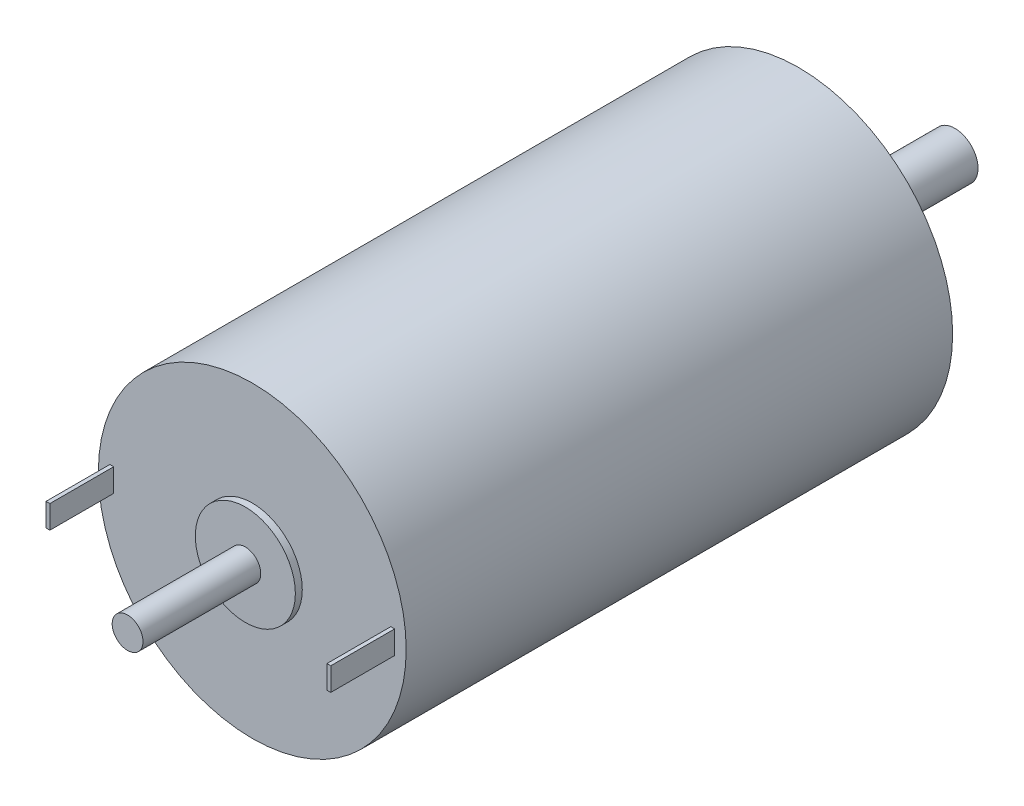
ISO-10303-21;
HEADER;
FILE_DESCRIPTION(('STEP AP214'),'2;1');
FILE_NAME('part.step','',(''),(''),'','','');
FILE_SCHEMA(('AUTOMOTIVE_DESIGN { 1 0 10303 214 1 1 1 1 }'));
ENDSEC;
DATA;
#1=APPLICATION_CONTEXT('core data for automotive mechanical design processes');
#2=APPLICATION_PROTOCOL_DEFINITION('international standard','automotive_design',2000,#1);
#3=PRODUCT_CONTEXT('',#1,'mechanical');
#4=PRODUCT('Part','Part','',(#3));
#5=PRODUCT_RELATED_PRODUCT_CATEGORY('part','',(#4));
#6=PRODUCT_DEFINITION_FORMATION('','',#4);
#7=PRODUCT_DEFINITION_CONTEXT('part definition',#1,'design');
#8=PRODUCT_DEFINITION('design','',#6,#7);
#9=PRODUCT_DEFINITION_SHAPE('','',#8);
#10=(LENGTH_UNIT() NAMED_UNIT(*) SI_UNIT(.MILLI.,.METRE.));
#11=(NAMED_UNIT(*) PLANE_ANGLE_UNIT() SI_UNIT($,.RADIAN.));
#12=(NAMED_UNIT(*) SI_UNIT($,.STERADIAN.) SOLID_ANGLE_UNIT());
#13=UNCERTAINTY_MEASURE_WITH_UNIT(LENGTH_MEASURE(1.E-05),#10,'distance_accuracy_value','');
#14=(GEOMETRIC_REPRESENTATION_CONTEXT(3) GLOBAL_UNCERTAINTY_ASSIGNED_CONTEXT((#13)) GLOBAL_UNIT_ASSIGNED_CONTEXT((#10,
#11,#12)) REPRESENTATION_CONTEXT('',''));
#15=CARTESIAN_POINT('',(0.,0.,0.));
#16=DIRECTION('',(0.,0.,1.));
#17=DIRECTION('',(1.,0.,0.));
#18=AXIS2_PLACEMENT_3D('',#15,#16,#17);
#19=CARTESIAN_POINT('',(0.,0.,-3.5));
#20=DIRECTION('',(0.,0.,-1.));
#21=DIRECTION('',(-1.,0.,0.));
#22=AXIS2_PLACEMENT_3D('',#19,#20,#21);
#23=PLANE('',#22);
#24=CARTESIAN_POINT('',(0.,0.,-3.5));
#25=DIRECTION('',(0.,0.,-1.));
#26=DIRECTION('',(-1.,0.,0.));
#27=AXIS2_PLACEMENT_3D('',#24,#25,#26);
#28=CIRCLE('',#27,4.);
#29=CARTESIAN_POINT('',(-4.,0.,-3.5));
#30=VERTEX_POINT('',#29);
#31=EDGE_CURVE('E328',#30,#30,#28,.T.);
#32=ORIENTED_EDGE('',*,*,#31,.T.);
#33=EDGE_LOOP('',(#32));
#34=FACE_BOUND('',#33,.T.);
#35=CARTESIAN_POINT('',(0.,0.,-3.5));
#36=DIRECTION('',(0.,0.,-1.));
#37=DIRECTION('',(-1.,0.,0.));
#38=AXIS2_PLACEMENT_3D('',#35,#36,#37);
#39=CIRCLE('',#38,3.);
#40=CARTESIAN_POINT('',(-3.,0.,-3.5));
#41=VERTEX_POINT('',#40);
#42=EDGE_CURVE('E34',#41,#41,#39,.F.);
#43=ORIENTED_EDGE('',*,*,#42,.T.);
#44=EDGE_LOOP('',(#43));
#45=FACE_BOUND('',#44,.T.);
#46=ADVANCED_FACE('F30',(#34,#45),#23,.T.);
#47=CARTESIAN_POINT('',(0.,0.,-1.4));
#48=DIRECTION('',(0.,0.,-1.));
#49=DIRECTION('',(-1.,0.,0.));
#50=AXIS2_PLACEMENT_3D('',#47,#48,#49);
#51=PLANE('',#50);
#52=CARTESIAN_POINT('',(0.,0.,-1.4));
#53=DIRECTION('',(0.,0.,-1.));
#54=DIRECTION('',(-1.,0.,0.));
#55=AXIS2_PLACEMENT_3D('',#52,#53,#54);
#56=CIRCLE('',#55,8.);
#57=CARTESIAN_POINT('',(-8.,0.,-1.4));
#58=VERTEX_POINT('',#57);
#59=EDGE_CURVE('E119',#58,#58,#56,.T.);
#60=ORIENTED_EDGE('',*,*,#59,.T.);
#61=EDGE_LOOP('',(#60));
#62=FACE_BOUND('',#61,.T.);
#63=CARTESIAN_POINT('',(0.,0.,-1.4));
#64=DIRECTION('',(0.,0.,-1.));
#65=DIRECTION('',(-1.,0.,0.));
#66=AXIS2_PLACEMENT_3D('',#63,#64,#65);
#67=CIRCLE('',#66,4.);
#68=CARTESIAN_POINT('',(-4.,0.,-1.4));
#69=VERTEX_POINT('',#68);
#70=EDGE_CURVE('E325',#69,#69,#67,.T.);
#71=ORIENTED_EDGE('',*,*,#70,.F.);
#72=EDGE_LOOP('',(#71));
#73=FACE_BOUND('',#72,.T.);
#74=ADVANCED_FACE('F195',(#62,#73),#51,.T.);
#75=CARTESIAN_POINT('',(0.,0.,0.));
#76=DIRECTION('',(0.,0.,1.));
#77=DIRECTION('',(1.,0.,0.));
#78=AXIS2_PLACEMENT_3D('',#75,#76,#77);
#79=PLANE('',#78);
#80=CARTESIAN_POINT('',(-5.50000000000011,9.52627944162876,0.));
#81=DIRECTION('',(0.,0.,-1.));
#82=DIRECTION('',(-1.,0.,0.));
#83=AXIS2_PLACEMENT_3D('',#80,#81,#82);
#84=CIRCLE('',#83,1.5);
#85=CARTESIAN_POINT('',(-7.00000000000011,9.52627944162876,0.));
#86=VERTEX_POINT('',#85);
#87=EDGE_CURVE('E288',#86,#86,#84,.T.);
#88=ORIENTED_EDGE('',*,*,#87,.F.);
#89=EDGE_LOOP('',(#88));
#90=FACE_BOUND('',#89,.T.);
#91=CARTESIAN_POINT('',(5.49999999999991,9.52627944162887,0.));
#92=DIRECTION('',(0.,0.,-1.));
#93=DIRECTION('',(-1.,0.,0.));
#94=AXIS2_PLACEMENT_3D('',#91,#92,#93);
#95=CIRCLE('',#94,1.5);
#96=CARTESIAN_POINT('',(3.99999999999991,9.52627944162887,0.));
#97=VERTEX_POINT('',#96);
#98=EDGE_CURVE('E287',#97,#97,#95,.T.);
#99=ORIENTED_EDGE('',*,*,#98,.F.);
#100=EDGE_LOOP('',(#99));
#101=FACE_BOUND('',#100,.T.);
#102=CARTESIAN_POINT('',(11.,0.,0.));
#103=DIRECTION('',(0.,0.,-1.));
#104=DIRECTION('',(-1.,0.,0.));
#105=AXIS2_PLACEMENT_3D('',#102,#103,#104);
#106=CIRCLE('',#105,1.5);
#107=CARTESIAN_POINT('',(9.5,0.,0.));
#108=VERTEX_POINT('',#107);
#109=EDGE_CURVE('E298',#108,#108,#106,.T.);
#110=ORIENTED_EDGE('',*,*,#109,.F.);
#111=EDGE_LOOP('',(#110));
#112=FACE_BOUND('',#111,.T.);
#113=CARTESIAN_POINT('',(5.50000000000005,-9.5262794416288,0.));
#114=DIRECTION('',(0.,0.,-1.));
#115=DIRECTION('',(-1.,0.,0.));
#116=AXIS2_PLACEMENT_3D('',#113,#114,#115);
#117=CIRCLE('',#116,1.5);
#118=CARTESIAN_POINT('',(4.00000000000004,-9.5262794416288,0.));
#119=VERTEX_POINT('',#118);
#120=EDGE_CURVE('E304',#119,#119,#117,.T.);
#121=ORIENTED_EDGE('',*,*,#120,.F.);
#122=EDGE_LOOP('',(#121));
#123=FACE_BOUND('',#122,.T.);
#124=CARTESIAN_POINT('',(-5.49999999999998,-9.52627944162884,0.));
#125=DIRECTION('',(0.,0.,-1.));
#126=DIRECTION('',(-1.,0.,0.));
#127=AXIS2_PLACEMENT_3D('',#124,#125,#126);
#128=CIRCLE('',#127,1.5);
#129=CARTESIAN_POINT('',(-6.99999999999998,-9.52627944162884,0.));
#130=VERTEX_POINT('',#129);
#131=EDGE_CURVE('E310',#130,#130,#128,.T.);
#132=ORIENTED_EDGE('',*,*,#131,.F.);
#133=EDGE_LOOP('',(#132));
#134=FACE_BOUND('',#133,.T.);
#135=CARTESIAN_POINT('',(-11.,0.,0.));
#136=DIRECTION('',(0.,0.,-1.));
#137=DIRECTION('',(-1.,0.,0.));
#138=AXIS2_PLACEMENT_3D('',#135,#136,#137);
#139=CIRCLE('',#138,1.5);
#140=CARTESIAN_POINT('',(-12.5,0.,0.));
#141=VERTEX_POINT('',#140);
#142=EDGE_CURVE('E316',#141,#141,#139,.T.);
#143=ORIENTED_EDGE('',*,*,#142,.F.);
#144=EDGE_LOOP('',(#143));
#145=FACE_BOUND('',#144,.T.);
#146=CARTESIAN_POINT('',(0.,0.,0.));
#147=DIRECTION('',(0.,0.,1.));
#148=DIRECTION('',(1.,0.,0.));
#149=AXIS2_PLACEMENT_3D('',#146,#147,#148);
#150=CIRCLE('',#149,20.);
#151=CARTESIAN_POINT('',(20.,0.,0.));
#152=VERTEX_POINT('',#151);
#153=EDGE_CURVE('E178',#152,#152,#150,.T.);
#154=ORIENTED_EDGE('',*,*,#153,.F.);
#155=EDGE_LOOP('',(#154));
#156=FACE_BOUND('',#155,.T.);
#157=CARTESIAN_POINT('',(0.,0.,0.));
#158=DIRECTION('',(0.,0.,1.));
#159=DIRECTION('',(1.,0.,0.));
#160=AXIS2_PLACEMENT_3D('',#157,#158,#159);
#161=CIRCLE('',#160,8.);
#162=CARTESIAN_POINT('',(8.,0.,0.));
#163=VERTEX_POINT('',#162);
#164=EDGE_CURVE('E11',#163,#163,#161,.F.);
#165=ORIENTED_EDGE('',*,*,#164,.F.);
#166=EDGE_LOOP('',(#165));
#167=FACE_BOUND('',#166,.T.);
#168=ADVANCED_FACE('F192',(#90,#101,#112,#123,#134,#145,#156,#167),#79,.F.);
#169=CARTESIAN_POINT('',(0.,0.,71.));
#170=DIRECTION('',(0.,0.,1.));
#171=DIRECTION('',(1.,0.,0.));
#172=AXIS2_PLACEMENT_3D('',#169,#170,#171);
#173=PLANE('',#172);
#174=DIRECTION('',(1.,0.,0.));
#175=VECTOR('',#174,1.);
#176=CARTESIAN_POINT('',(18.,-1.41730177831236,71.));
#177=LINE('',#176,#175);
#178=CARTESIAN_POINT('',(18.,-1.41730177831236,71.));
#179=VERTEX_POINT('',#178);
#180=CARTESIAN_POINT('',(18.5,-1.41730177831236,71.));
#181=VERTEX_POINT('',#180);
#182=EDGE_CURVE('E142',#179,#181,#177,.T.);
#183=ORIENTED_EDGE('',*,*,#182,.F.);
#184=DIRECTION('',(0.,-1.,0.));
#185=VECTOR('',#184,1.);
#186=CARTESIAN_POINT('',(18.,1.58269822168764,71.));
#187=LINE('',#186,#185);
#188=CARTESIAN_POINT('',(18.,1.58269822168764,71.));
#189=VERTEX_POINT('',#188);
#190=EDGE_CURVE('E108',#189,#179,#187,.T.);
#191=ORIENTED_EDGE('',*,*,#190,.F.);
#192=DIRECTION('',(-1.,0.,0.));
#193=VECTOR('',#192,1.);
#194=CARTESIAN_POINT('',(18.,1.58269822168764,71.));
#195=LINE('',#194,#193);
#196=CARTESIAN_POINT('',(18.5,1.58269822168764,71.));
#197=VERTEX_POINT('',#196);
#198=EDGE_CURVE('E146',#197,#189,#195,.T.);
#199=ORIENTED_EDGE('',*,*,#198,.F.);
#200=DIRECTION('',(0.,1.,0.));
#201=VECTOR('',#200,1.);
#202=CARTESIAN_POINT('',(18.5,1.58269822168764,71.));
#203=LINE('',#202,#201);
#204=EDGE_CURVE('E144',#181,#197,#203,.T.);
#205=ORIENTED_EDGE('',*,*,#204,.F.);
#206=EDGE_LOOP('',(#183,#191,#199,#205));
#207=FACE_BOUND('',#206,.T.);
#208=CARTESIAN_POINT('',(0.,0.,71.));
#209=DIRECTION('',(0.,0.,1.));
#210=DIRECTION('',(1.,0.,0.));
#211=AXIS2_PLACEMENT_3D('',#208,#209,#210);
#212=CIRCLE('',#211,20.);
#213=CARTESIAN_POINT('',(20.,0.,71.));
#214=VERTEX_POINT('',#213);
#215=EDGE_CURVE('E39',#214,#214,#212,.T.);
#216=ORIENTED_EDGE('',*,*,#215,.T.);
#217=EDGE_LOOP('',(#216));
#218=FACE_BOUND('',#217,.T.);
#219=CARTESIAN_POINT('',(0.,0.,71.));
#220=DIRECTION('',(0.,0.,1.));
#221=DIRECTION('',(1.,0.,0.));
#222=AXIS2_PLACEMENT_3D('',#219,#220,#221);
#223=CIRCLE('',#222,6.5);
#224=CARTESIAN_POINT('',(6.5,0.,71.));
#225=VERTEX_POINT('',#224);
#226=EDGE_CURVE('E172',#225,#225,#223,.T.);
#227=ORIENTED_EDGE('',*,*,#226,.F.);
#228=EDGE_LOOP('',(#227));
#229=FACE_BOUND('',#228,.T.);
#230=DIRECTION('',(0.,-1.,0.));
#231=VECTOR('',#230,1.);
#232=CARTESIAN_POINT('',(-18.5,1.58269822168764,71.));
#233=LINE('',#232,#231);
#234=CARTESIAN_POINT('',(-18.5,1.58269822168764,71.));
#235=VERTEX_POINT('',#234);
#236=CARTESIAN_POINT('',(-18.5,-1.41730177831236,71.));
#237=VERTEX_POINT('',#236);
#238=EDGE_CURVE('E102',#235,#237,#233,.T.);
#239=ORIENTED_EDGE('',*,*,#238,.F.);
#240=DIRECTION('',(-1.,0.,0.));
#241=VECTOR('',#240,1.);
#242=CARTESIAN_POINT('',(-18.,1.58269822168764,71.));
#243=LINE('',#242,#241);
#244=CARTESIAN_POINT('',(-18.,1.58269822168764,71.));
#245=VERTEX_POINT('',#244);
#246=EDGE_CURVE('E113',#245,#235,#243,.T.);
#247=ORIENTED_EDGE('',*,*,#246,.F.);
#248=DIRECTION('',(0.,1.,0.));
#249=VECTOR('',#248,1.);
#250=CARTESIAN_POINT('',(-18.,1.58269822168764,71.));
#251=LINE('',#250,#249);
#252=CARTESIAN_POINT('',(-18.,-1.41730177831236,71.));
#253=VERTEX_POINT('',#252);
#254=EDGE_CURVE('E125',#253,#245,#251,.T.);
#255=ORIENTED_EDGE('',*,*,#254,.F.);
#256=DIRECTION('',(1.,0.,0.));
#257=VECTOR('',#256,1.);
#258=CARTESIAN_POINT('',(-18.,-1.41730177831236,71.));
#259=LINE('',#258,#257);
#260=EDGE_CURVE('E123',#237,#253,#259,.T.);
#261=ORIENTED_EDGE('',*,*,#260,.F.);
#262=EDGE_LOOP('',(#239,#247,#255,#261));
#263=FACE_BOUND('',#262,.T.);
#264=ADVANCED_FACE('F122',(#207,#218,#229,#263),#173,.T.);
#265=CARTESIAN_POINT('',(0.,0.,71.9));
#266=DIRECTION('',(0.,0.,1.));
#267=DIRECTION('',(1.,0.,0.));
#268=AXIS2_PLACEMENT_3D('',#265,#266,#267);
#269=PLANE('',#268);
#270=CARTESIAN_POINT('',(0.,0.,71.9));
#271=DIRECTION('',(0.,0.,1.));
#272=DIRECTION('',(1.,0.,0.));
#273=AXIS2_PLACEMENT_3D('',#270,#271,#272);
#274=CIRCLE('',#273,6.5);
#275=CARTESIAN_POINT('',(6.5,0.,71.9));
#276=VERTEX_POINT('',#275);
#277=EDGE_CURVE('E175',#276,#276,#274,.T.);
#278=ORIENTED_EDGE('',*,*,#277,.T.);
#279=EDGE_LOOP('',(#278));
#280=FACE_BOUND('',#279,.T.);
#281=CARTESIAN_POINT('',(0.,0.,71.9));
#282=DIRECTION('',(0.,0.,1.));
#283=DIRECTION('',(1.,0.,0.));
#284=AXIS2_PLACEMENT_3D('',#281,#282,#283);
#285=CIRCLE('',#284,2.);
#286=CARTESIAN_POINT('',(2.,0.,71.9));
#287=VERTEX_POINT('',#286);
#288=EDGE_CURVE('E166',#287,#287,#285,.T.);
#289=ORIENTED_EDGE('',*,*,#288,.F.);
#290=EDGE_LOOP('',(#289));
#291=FACE_BOUND('',#290,.T.);
#292=ADVANCED_FACE('F189',(#280,#291),#269,.T.);
#293=CARTESIAN_POINT('',(0.,0.,71.));
#294=DIRECTION('',(0.,0.,-1.));
#295=DIRECTION('',(-1.,0.,0.));
#296=AXIS2_PLACEMENT_3D('',#293,#294,#295);
#297=CYLINDRICAL_SURFACE('',#296,20.);
#298=ORIENTED_EDGE('',*,*,#215,.F.);
#299=EDGE_LOOP('',(#298));
#300=FACE_BOUND('',#299,.T.);
#301=ORIENTED_EDGE('',*,*,#153,.T.);
#302=EDGE_LOOP('',(#301));
#303=FACE_BOUND('',#302,.T.);
#304=ADVANCED_FACE('F32',(#300,#303),#297,.T.);
#305=CARTESIAN_POINT('',(0.,0.,71.9));
#306=DIRECTION('',(0.,0.,-1.));
#307=DIRECTION('',(-1.,0.,0.));
#308=AXIS2_PLACEMENT_3D('',#305,#306,#307);
#309=CYLINDRICAL_SURFACE('',#308,6.5);
#310=ORIENTED_EDGE('',*,*,#277,.F.);
#311=EDGE_LOOP('',(#310));
#312=FACE_BOUND('',#311,.T.);
#313=ORIENTED_EDGE('',*,*,#226,.T.);
#314=EDGE_LOOP('',(#313));
#315=FACE_BOUND('',#314,.T.);
#316=ADVANCED_FACE('F188',(#312,#315),#309,.T.);
#317=CARTESIAN_POINT('',(0.,0.,87.2));
#318=DIRECTION('',(0.,0.,-1.));
#319=DIRECTION('',(-1.,0.,0.));
#320=AXIS2_PLACEMENT_3D('',#317,#318,#319);
#321=CYLINDRICAL_SURFACE('',#320,2.);
#322=CARTESIAN_POINT('',(0.,0.,87.2));
#323=DIRECTION('',(0.,0.,1.));
#324=DIRECTION('',(1.,0.,0.));
#325=AXIS2_PLACEMENT_3D('',#322,#323,#324);
#326=CIRCLE('',#325,2.);
#327=CARTESIAN_POINT('',(2.,0.,87.2));
#328=VERTEX_POINT('',#327);
#329=EDGE_CURVE('E169',#328,#328,#326,.T.);
#330=ORIENTED_EDGE('',*,*,#329,.F.);
#331=EDGE_LOOP('',(#330));
#332=FACE_BOUND('',#331,.T.);
#333=ORIENTED_EDGE('',*,*,#288,.T.);
#334=EDGE_LOOP('',(#333));
#335=FACE_BOUND('',#334,.T.);
#336=ADVANCED_FACE('F568',(#332,#335),#321,.T.);
#337=CARTESIAN_POINT('',(0.,0.,87.2));
#338=DIRECTION('',(0.,0.,1.));
#339=DIRECTION('',(1.,0.,0.));
#340=AXIS2_PLACEMENT_3D('',#337,#338,#339);
#341=PLANE('',#340);
#342=ORIENTED_EDGE('',*,*,#329,.T.);
#343=EDGE_LOOP('',(#342));
#344=FACE_BOUND('',#343,.T.);
#345=ADVANCED_FACE('F549',(#344),#341,.T.);
#346=CARTESIAN_POINT('',(18.,1.58269822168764,79.3));
#347=DIRECTION('',(1.,0.,0.));
#348=DIRECTION('',(0.,0.,-1.));
#349=AXIS2_PLACEMENT_3D('',#346,#347,#348);
#350=PLANE('',#349);
#351=ORIENTED_EDGE('',*,*,#190,.T.);
#352=DIRECTION('',(0.,0.,-1.));
#353=VECTOR('',#352,1.);
#354=CARTESIAN_POINT('',(18.,-1.41730177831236,79.3));
#355=LINE('',#354,#353);
#356=CARTESIAN_POINT('',(18.,-1.41730177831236,79.3));
#357=VERTEX_POINT('',#356);
#358=EDGE_CURVE('E164',#357,#179,#355,.T.);
#359=ORIENTED_EDGE('',*,*,#358,.F.);
#360=DIRECTION('',(0.,-1.,0.));
#361=VECTOR('',#360,1.);
#362=CARTESIAN_POINT('',(18.,1.58269822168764,79.3));
#363=LINE('',#362,#361);
#364=CARTESIAN_POINT('',(18.,1.58269822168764,79.3));
#365=VERTEX_POINT('',#364);
#366=EDGE_CURVE('E148',#365,#357,#363,.T.);
#367=ORIENTED_EDGE('',*,*,#366,.F.);
#368=DIRECTION('',(0.,0.,-1.));
#369=VECTOR('',#368,1.);
#370=CARTESIAN_POINT('',(18.,1.58269822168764,79.3));
#371=LINE('',#370,#369);
#372=EDGE_CURVE('E157',#365,#189,#371,.T.);
#373=ORIENTED_EDGE('',*,*,#372,.T.);
#374=EDGE_LOOP('',(#351,#359,#367,#373));
#375=FACE_BOUND('',#374,.T.);
#376=ADVANCED_FACE('F539',(#375),#350,.F.);
#377=CARTESIAN_POINT('',(18.,-1.41730177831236,79.3));
#378=DIRECTION('',(0.,1.,0.));
#379=DIRECTION('',(0.,0.,1.));
#380=AXIS2_PLACEMENT_3D('',#377,#378,#379);
#381=PLANE('',#380);
#382=ORIENTED_EDGE('',*,*,#182,.T.);
#383=DIRECTION('',(0.,0.,-1.));
#384=VECTOR('',#383,1.);
#385=CARTESIAN_POINT('',(18.5,-1.41730177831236,79.3));
#386=LINE('',#385,#384);
#387=CARTESIAN_POINT('',(18.5,-1.41730177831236,79.3));
#388=VERTEX_POINT('',#387);
#389=EDGE_CURVE('E161',#388,#181,#386,.T.);
#390=ORIENTED_EDGE('',*,*,#389,.F.);
#391=DIRECTION('',(1.,0.,0.));
#392=VECTOR('',#391,1.);
#393=CARTESIAN_POINT('',(18.,-1.41730177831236,79.3));
#394=LINE('',#393,#392);
#395=EDGE_CURVE('E151',#357,#388,#394,.T.);
#396=ORIENTED_EDGE('',*,*,#395,.F.);
#397=ORIENTED_EDGE('',*,*,#358,.T.);
#398=EDGE_LOOP('',(#382,#390,#396,#397));
#399=FACE_BOUND('',#398,.T.);
#400=ADVANCED_FACE('F529',(#399),#381,.F.);
#401=CARTESIAN_POINT('',(18.5,1.58269822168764,79.3));
#402=DIRECTION('',(-1.,0.,0.));
#403=DIRECTION('',(0.,0.,1.));
#404=AXIS2_PLACEMENT_3D('',#401,#402,#403);
#405=PLANE('',#404);
#406=ORIENTED_EDGE('',*,*,#204,.T.);
#407=DIRECTION('',(0.,0.,-1.));
#408=VECTOR('',#407,1.);
#409=CARTESIAN_POINT('',(18.5,1.58269822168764,79.3));
#410=LINE('',#409,#408);
#411=CARTESIAN_POINT('',(18.5,1.58269822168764,79.3));
#412=VERTEX_POINT('',#411);
#413=EDGE_CURVE('E54',#412,#197,#410,.T.);
#414=ORIENTED_EDGE('',*,*,#413,.F.);
#415=DIRECTION('',(0.,1.,0.));
#416=VECTOR('',#415,1.);
#417=CARTESIAN_POINT('',(18.5,1.58269822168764,79.3));
#418=LINE('',#417,#416);
#419=EDGE_CURVE('E153',#388,#412,#418,.T.);
#420=ORIENTED_EDGE('',*,*,#419,.F.);
#421=ORIENTED_EDGE('',*,*,#389,.T.);
#422=EDGE_LOOP('',(#406,#414,#420,#421));
#423=FACE_BOUND('',#422,.T.);
#424=ADVANCED_FACE('F520',(#423),#405,.F.);
#425=CARTESIAN_POINT('',(18.,1.58269822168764,79.3));
#426=DIRECTION('',(0.,-1.,0.));
#427=DIRECTION('',(0.,0.,-1.));
#428=AXIS2_PLACEMENT_3D('',#425,#426,#427);
#429=PLANE('',#428);
#430=ORIENTED_EDGE('',*,*,#198,.T.);
#431=ORIENTED_EDGE('',*,*,#372,.F.);
#432=DIRECTION('',(-1.,0.,0.));
#433=VECTOR('',#432,1.);
#434=CARTESIAN_POINT('',(18.,1.58269822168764,79.3));
#435=LINE('',#434,#433);
#436=EDGE_CURVE('E155',#412,#365,#435,.T.);
#437=ORIENTED_EDGE('',*,*,#436,.F.);
#438=ORIENTED_EDGE('',*,*,#413,.T.);
#439=EDGE_LOOP('',(#430,#431,#437,#438));
#440=FACE_BOUND('',#439,.T.);
#441=ADVANCED_FACE('F510',(#440),#429,.F.);
#442=CARTESIAN_POINT('',(18.,-1.41730177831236,79.3));
#443=DIRECTION('',(0.,0.,1.));
#444=DIRECTION('',(1.,0.,0.));
#445=AXIS2_PLACEMENT_3D('',#442,#443,#444);
#446=PLANE('',#445);
#447=ORIENTED_EDGE('',*,*,#366,.T.);
#448=ORIENTED_EDGE('',*,*,#395,.T.);
#449=ORIENTED_EDGE('',*,*,#419,.T.);
#450=ORIENTED_EDGE('',*,*,#436,.T.);
#451=EDGE_LOOP('',(#447,#448,#449,#450));
#452=FACE_BOUND('',#451,.T.);
#453=ADVANCED_FACE('F501',(#452),#446,.T.);
#454=CARTESIAN_POINT('',(-18.,1.58269822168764,79.3));
#455=DIRECTION('',(0.,-1.,0.));
#456=DIRECTION('',(0.,0.,-1.));
#457=AXIS2_PLACEMENT_3D('',#454,#455,#456);
#458=PLANE('',#457);
#459=ORIENTED_EDGE('',*,*,#246,.T.);
#460=DIRECTION('',(0.,0.,-1.));
#461=VECTOR('',#460,1.);
#462=CARTESIAN_POINT('',(-18.5,1.58269822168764,79.3));
#463=LINE('',#462,#461);
#464=CARTESIAN_POINT('',(-18.5,1.58269822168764,79.3));
#465=VERTEX_POINT('',#464);
#466=EDGE_CURVE('E97',#465,#235,#463,.T.);
#467=ORIENTED_EDGE('',*,*,#466,.F.);
#468=DIRECTION('',(-1.,0.,0.));
#469=VECTOR('',#468,1.);
#470=CARTESIAN_POINT('',(-18.,1.58269822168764,79.3));
#471=LINE('',#470,#469);
#472=CARTESIAN_POINT('',(-18.,1.58269822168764,79.3));
#473=VERTEX_POINT('',#472);
#474=EDGE_CURVE('E130',#473,#465,#471,.T.);
#475=ORIENTED_EDGE('',*,*,#474,.F.);
#476=DIRECTION('',(0.,0.,-1.));
#477=VECTOR('',#476,1.);
#478=CARTESIAN_POINT('',(-18.,1.58269822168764,79.3));
#479=LINE('',#478,#477);
#480=EDGE_CURVE('E116',#473,#245,#479,.T.);
#481=ORIENTED_EDGE('',*,*,#480,.T.);
#482=EDGE_LOOP('',(#459,#467,#475,#481));
#483=FACE_BOUND('',#482,.T.);
#484=ADVANCED_FACE('F114',(#483),#458,.F.);
#485=CARTESIAN_POINT('',(-18.5,1.58269822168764,79.3));
#486=DIRECTION('',(1.,0.,0.));
#487=DIRECTION('',(0.,0.,-1.));
#488=AXIS2_PLACEMENT_3D('',#485,#486,#487);
#489=PLANE('',#488);
#490=ORIENTED_EDGE('',*,*,#238,.T.);
#491=DIRECTION('',(0.,0.,-1.));
#492=VECTOR('',#491,1.);
#493=CARTESIAN_POINT('',(-18.5,-1.41730177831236,79.3));
#494=LINE('',#493,#492);
#495=CARTESIAN_POINT('',(-18.5,-1.41730177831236,79.3));
#496=VERTEX_POINT('',#495);
#497=EDGE_CURVE('E109',#496,#237,#494,.T.);
#498=ORIENTED_EDGE('',*,*,#497,.F.);
#499=DIRECTION('',(0.,-1.,0.));
#500=VECTOR('',#499,1.);
#501=CARTESIAN_POINT('',(-18.5,1.58269822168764,79.3));
#502=LINE('',#501,#500);
#503=EDGE_CURVE('E104',#465,#496,#502,.T.);
#504=ORIENTED_EDGE('',*,*,#503,.F.);
#505=ORIENTED_EDGE('',*,*,#466,.T.);
#506=EDGE_LOOP('',(#490,#498,#504,#505));
#507=FACE_BOUND('',#506,.T.);
#508=ADVANCED_FACE('F99',(#507),#489,.F.);
#509=CARTESIAN_POINT('',(-18.,-1.41730177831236,79.3));
#510=DIRECTION('',(0.,1.,0.));
#511=DIRECTION('',(0.,0.,1.));
#512=AXIS2_PLACEMENT_3D('',#509,#510,#511);
#513=PLANE('',#512);
#514=ORIENTED_EDGE('',*,*,#260,.T.);
#515=DIRECTION('',(0.,0.,-1.));
#516=VECTOR('',#515,1.);
#517=CARTESIAN_POINT('',(-18.,-1.41730177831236,79.3));
#518=LINE('',#517,#516);
#519=CARTESIAN_POINT('',(-18.,-1.41730177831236,79.3));
#520=VERTEX_POINT('',#519);
#521=EDGE_CURVE('E46',#520,#253,#518,.T.);
#522=ORIENTED_EDGE('',*,*,#521,.F.);
#523=DIRECTION('',(1.,0.,0.));
#524=VECTOR('',#523,1.);
#525=CARTESIAN_POINT('',(-18.,-1.41730177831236,79.3));
#526=LINE('',#525,#524);
#527=EDGE_CURVE('E133',#496,#520,#526,.T.);
#528=ORIENTED_EDGE('',*,*,#527,.F.);
#529=ORIENTED_EDGE('',*,*,#497,.T.);
#530=EDGE_LOOP('',(#514,#522,#528,#529));
#531=FACE_BOUND('',#530,.T.);
#532=ADVANCED_FACE('F475',(#531),#513,.F.);
#533=CARTESIAN_POINT('',(-18.,1.58269822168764,79.3));
#534=DIRECTION('',(-1.,0.,0.));
#535=DIRECTION('',(0.,0.,1.));
#536=AXIS2_PLACEMENT_3D('',#533,#534,#535);
#537=PLANE('',#536);
#538=ORIENTED_EDGE('',*,*,#254,.T.);
#539=ORIENTED_EDGE('',*,*,#480,.F.);
#540=DIRECTION('',(0.,1.,0.));
#541=VECTOR('',#540,1.);
#542=CARTESIAN_POINT('',(-18.,1.58269822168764,79.3));
#543=LINE('',#542,#541);
#544=EDGE_CURVE('E135',#520,#473,#543,.T.);
#545=ORIENTED_EDGE('',*,*,#544,.F.);
#546=ORIENTED_EDGE('',*,*,#521,.T.);
#547=EDGE_LOOP('',(#538,#539,#545,#546));
#548=FACE_BOUND('',#547,.T.);
#549=ADVANCED_FACE('F213',(#548),#537,.F.);
#550=CARTESIAN_POINT('',(-18.5,1.58269822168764,79.3));
#551=DIRECTION('',(0.,0.,1.));
#552=DIRECTION('',(1.,0.,0.));
#553=AXIS2_PLACEMENT_3D('',#550,#551,#552);
#554=PLANE('',#553);
#555=ORIENTED_EDGE('',*,*,#474,.T.);
#556=ORIENTED_EDGE('',*,*,#503,.T.);
#557=ORIENTED_EDGE('',*,*,#527,.T.);
#558=ORIENTED_EDGE('',*,*,#544,.T.);
#559=EDGE_LOOP('',(#555,#556,#557,#558));
#560=FACE_BOUND('',#559,.T.);
#561=ADVANCED_FACE('F203',(#560),#554,.T.);
#562=CARTESIAN_POINT('',(0.,0.,-1.4));
#563=DIRECTION('',(0.,0.,1.));
#564=DIRECTION('',(1.,0.,0.));
#565=AXIS2_PLACEMENT_3D('',#562,#563,#564);
#566=CYLINDRICAL_SURFACE('',#565,8.);
#567=ORIENTED_EDGE('',*,*,#59,.F.);
#568=EDGE_LOOP('',(#567));
#569=FACE_BOUND('',#568,.T.);
#570=ORIENTED_EDGE('',*,*,#164,.T.);
#571=EDGE_LOOP('',(#570));
#572=FACE_BOUND('',#571,.T.);
#573=ADVANCED_FACE('F200',(#569,#572),#566,.T.);
#574=CARTESIAN_POINT('',(0.,0.,-3.5));
#575=DIRECTION('',(0.,0.,1.));
#576=DIRECTION('',(1.,0.,0.));
#577=AXIS2_PLACEMENT_3D('',#574,#575,#576);
#578=CYLINDRICAL_SURFACE('',#577,4.);
#579=ORIENTED_EDGE('',*,*,#31,.F.);
#580=EDGE_LOOP('',(#579));
#581=FACE_BOUND('',#580,.T.);
#582=ORIENTED_EDGE('',*,*,#70,.T.);
#583=EDGE_LOOP('',(#582));
#584=FACE_BOUND('',#583,.T.);
#585=ADVANCED_FACE('F202',(#581,#584),#578,.T.);
#586=CARTESIAN_POINT('',(0.,0.,-20.3));
#587=DIRECTION('',(0.,0.,1.));
#588=DIRECTION('',(1.,0.,0.));
#589=AXIS2_PLACEMENT_3D('',#586,#587,#588);
#590=CYLINDRICAL_SURFACE('',#589,3.);
#591=ORIENTED_EDGE('',*,*,#42,.F.);
#592=EDGE_LOOP('',(#591));
#593=FACE_BOUND('',#592,.T.);
#594=CARTESIAN_POINT('',(0.,0.,-20.3));
#595=DIRECTION('',(0.,0.,-1.));
#596=DIRECTION('',(-1.,0.,0.));
#597=AXIS2_PLACEMENT_3D('',#594,#595,#596);
#598=CIRCLE('',#597,3.);
#599=CARTESIAN_POINT('',(-3.,0.,-20.3));
#600=VERTEX_POINT('',#599);
#601=EDGE_CURVE('E322',#600,#600,#598,.T.);
#602=ORIENTED_EDGE('',*,*,#601,.F.);
#603=EDGE_LOOP('',(#602));
#604=FACE_BOUND('',#603,.T.);
#605=ADVANCED_FACE('F210',(#593,#604),#590,.T.);
#606=CARTESIAN_POINT('',(0.,0.,-20.3));
#607=DIRECTION('',(0.,0.,-1.));
#608=DIRECTION('',(-1.,0.,0.));
#609=AXIS2_PLACEMENT_3D('',#606,#607,#608);
#610=PLANE('',#609);
#611=ORIENTED_EDGE('',*,*,#601,.T.);
#612=EDGE_LOOP('',(#611));
#613=FACE_BOUND('',#612,.T.);
#614=ADVANCED_FACE('F230',(#613),#610,.T.);
#615=CARTESIAN_POINT('',(-11.,0.,5.));
#616=DIRECTION('',(0.,0.,-1.));
#617=DIRECTION('',(-1.,0.,0.));
#618=AXIS2_PLACEMENT_3D('',#615,#616,#617);
#619=CYLINDRICAL_SURFACE('',#618,1.5);
#620=CARTESIAN_POINT('',(-11.,0.,5.));
#621=DIRECTION('',(0.,0.,-1.));
#622=DIRECTION('',(-1.,0.,0.));
#623=AXIS2_PLACEMENT_3D('',#620,#621,#622);
#624=CIRCLE('',#623,1.5);
#625=CARTESIAN_POINT('',(-12.5,0.,5.));
#626=VERTEX_POINT('',#625);
#627=EDGE_CURVE('E319',#626,#626,#624,.T.);
#628=ORIENTED_EDGE('',*,*,#627,.F.);
#629=EDGE_LOOP('',(#628));
#630=FACE_BOUND('',#629,.T.);
#631=ORIENTED_EDGE('',*,*,#142,.T.);
#632=EDGE_LOOP('',(#631));
#633=FACE_BOUND('',#632,.T.);
#634=ADVANCED_FACE('F234',(#630,#633),#619,.F.);
#635=CARTESIAN_POINT('',(-11.,0.,5.));
#636=DIRECTION('',(0.,0.,-1.));
#637=DIRECTION('',(-1.,0.,0.));
#638=AXIS2_PLACEMENT_3D('',#635,#636,#637);
#639=PLANE('',#638);
#640=ORIENTED_EDGE('',*,*,#627,.T.);
#641=EDGE_LOOP('',(#640));
#642=FACE_BOUND('',#641,.T.);
#643=ADVANCED_FACE('F238',(#642),#639,.T.);
#644=CARTESIAN_POINT('',(-5.49999999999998,-9.52627944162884,5.));
#645=DIRECTION('',(0.,0.,-1.));
#646=DIRECTION('',(-1.,0.,0.));
#647=AXIS2_PLACEMENT_3D('',#644,#645,#646);
#648=CYLINDRICAL_SURFACE('',#647,1.5);
#649=CARTESIAN_POINT('',(-5.49999999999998,-9.52627944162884,5.));
#650=DIRECTION('',(0.,0.,-1.));
#651=DIRECTION('',(-1.,0.,0.));
#652=AXIS2_PLACEMENT_3D('',#649,#650,#651);
#653=CIRCLE('',#652,1.5);
#654=CARTESIAN_POINT('',(-6.99999999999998,-9.52627944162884,5.));
#655=VERTEX_POINT('',#654);
#656=EDGE_CURVE('E313',#655,#655,#653,.T.);
#657=ORIENTED_EDGE('',*,*,#656,.F.);
#658=EDGE_LOOP('',(#657));
#659=FACE_BOUND('',#658,.T.);
#660=ORIENTED_EDGE('',*,*,#131,.T.);
#661=EDGE_LOOP('',(#660));
#662=FACE_BOUND('',#661,.T.);
#663=ADVANCED_FACE('F242',(#659,#662),#648,.F.);
#664=CARTESIAN_POINT('',(-5.49999999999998,-9.52627944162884,5.));
#665=DIRECTION('',(0.,0.,-1.));
#666=DIRECTION('',(-1.,0.,0.));
#667=AXIS2_PLACEMENT_3D('',#664,#665,#666);
#668=PLANE('',#667);
#669=ORIENTED_EDGE('',*,*,#656,.T.);
#670=EDGE_LOOP('',(#669));
#671=FACE_BOUND('',#670,.T.);
#672=ADVANCED_FACE('F246',(#671),#668,.T.);
#673=CARTESIAN_POINT('',(5.50000000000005,-9.5262794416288,5.));
#674=DIRECTION('',(0.,0.,-1.));
#675=DIRECTION('',(-1.,0.,0.));
#676=AXIS2_PLACEMENT_3D('',#673,#674,#675);
#677=CYLINDRICAL_SURFACE('',#676,1.5);
#678=CARTESIAN_POINT('',(5.50000000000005,-9.5262794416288,5.));
#679=DIRECTION('',(0.,0.,-1.));
#680=DIRECTION('',(-1.,0.,0.));
#681=AXIS2_PLACEMENT_3D('',#678,#679,#680);
#682=CIRCLE('',#681,1.5);
#683=CARTESIAN_POINT('',(4.00000000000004,-9.5262794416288,5.));
#684=VERTEX_POINT('',#683);
#685=EDGE_CURVE('E307',#684,#684,#682,.T.);
#686=ORIENTED_EDGE('',*,*,#685,.F.);
#687=EDGE_LOOP('',(#686));
#688=FACE_BOUND('',#687,.T.);
#689=ORIENTED_EDGE('',*,*,#120,.T.);
#690=EDGE_LOOP('',(#689));
#691=FACE_BOUND('',#690,.T.);
#692=ADVANCED_FACE('F250',(#688,#691),#677,.F.);
#693=CARTESIAN_POINT('',(5.50000000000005,-9.5262794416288,5.));
#694=DIRECTION('',(0.,0.,-1.));
#695=DIRECTION('',(-1.,0.,0.));
#696=AXIS2_PLACEMENT_3D('',#693,#694,#695);
#697=PLANE('',#696);
#698=ORIENTED_EDGE('',*,*,#685,.T.);
#699=EDGE_LOOP('',(#698));
#700=FACE_BOUND('',#699,.T.);
#701=ADVANCED_FACE('F254',(#700),#697,.T.);
#702=CARTESIAN_POINT('',(11.,0.,5.));
#703=DIRECTION('',(0.,0.,-1.));
#704=DIRECTION('',(-1.,0.,0.));
#705=AXIS2_PLACEMENT_3D('',#702,#703,#704);
#706=CYLINDRICAL_SURFACE('',#705,1.5);
#707=CARTESIAN_POINT('',(11.,0.,5.));
#708=DIRECTION('',(0.,0.,-1.));
#709=DIRECTION('',(-1.,0.,0.));
#710=AXIS2_PLACEMENT_3D('',#707,#708,#709);
#711=CIRCLE('',#710,1.5);
#712=CARTESIAN_POINT('',(9.5,0.,5.));
#713=VERTEX_POINT('',#712);
#714=EDGE_CURVE('E301',#713,#713,#711,.T.);
#715=ORIENTED_EDGE('',*,*,#714,.F.);
#716=EDGE_LOOP('',(#715));
#717=FACE_BOUND('',#716,.T.);
#718=ORIENTED_EDGE('',*,*,#109,.T.);
#719=EDGE_LOOP('',(#718));
#720=FACE_BOUND('',#719,.T.);
#721=ADVANCED_FACE('F258',(#717,#720),#706,.F.);
#722=CARTESIAN_POINT('',(11.,0.,5.));
#723=DIRECTION('',(0.,0.,-1.));
#724=DIRECTION('',(-1.,0.,0.));
#725=AXIS2_PLACEMENT_3D('',#722,#723,#724);
#726=PLANE('',#725);
#727=ORIENTED_EDGE('',*,*,#714,.T.);
#728=EDGE_LOOP('',(#727));
#729=FACE_BOUND('',#728,.T.);
#730=ADVANCED_FACE('F262',(#729),#726,.T.);
#731=CARTESIAN_POINT('',(5.49999999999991,9.52627944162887,5.));
#732=DIRECTION('',(0.,0.,-1.));
#733=DIRECTION('',(-1.,0.,0.));
#734=AXIS2_PLACEMENT_3D('',#731,#732,#733);
#735=CYLINDRICAL_SURFACE('',#734,1.5);
#736=CARTESIAN_POINT('',(5.49999999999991,9.52627944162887,5.));
#737=DIRECTION('',(0.,0.,-1.));
#738=DIRECTION('',(-1.,0.,0.));
#739=AXIS2_PLACEMENT_3D('',#736,#737,#738);
#740=CIRCLE('',#739,1.5);
#741=CARTESIAN_POINT('',(3.99999999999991,9.52627944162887,5.));
#742=VERTEX_POINT('',#741);
#743=EDGE_CURVE('E291',#742,#742,#740,.T.);
#744=ORIENTED_EDGE('',*,*,#743,.F.);
#745=EDGE_LOOP('',(#744));
#746=FACE_BOUND('',#745,.T.);
#747=ORIENTED_EDGE('',*,*,#98,.T.);
#748=EDGE_LOOP('',(#747));
#749=FACE_BOUND('',#748,.T.);
#750=ADVANCED_FACE('F266',(#746,#749),#735,.F.);
#751=CARTESIAN_POINT('',(5.49999999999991,9.52627944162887,5.));
#752=DIRECTION('',(0.,0.,-1.));
#753=DIRECTION('',(-1.,0.,0.));
#754=AXIS2_PLACEMENT_3D('',#751,#752,#753);
#755=PLANE('',#754);
#756=ORIENTED_EDGE('',*,*,#743,.T.);
#757=EDGE_LOOP('',(#756));
#758=FACE_BOUND('',#757,.T.);
#759=ADVANCED_FACE('F270',(#758),#755,.T.);
#760=CARTESIAN_POINT('',(-5.50000000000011,9.52627944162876,5.));
#761=DIRECTION('',(0.,0.,-1.));
#762=DIRECTION('',(-1.,0.,0.));
#763=AXIS2_PLACEMENT_3D('',#760,#761,#762);
#764=CYLINDRICAL_SURFACE('',#763,1.5);
#765=CARTESIAN_POINT('',(-5.50000000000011,9.52627944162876,5.));
#766=DIRECTION('',(0.,0.,-1.));
#767=DIRECTION('',(-1.,0.,0.));
#768=AXIS2_PLACEMENT_3D('',#765,#766,#767);
#769=CIRCLE('',#768,1.5);
#770=CARTESIAN_POINT('',(-7.00000000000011,9.52627944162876,5.));
#771=VERTEX_POINT('',#770);
#772=EDGE_CURVE('E286',#771,#771,#769,.T.);
#773=ORIENTED_EDGE('',*,*,#772,.F.);
#774=EDGE_LOOP('',(#773));
#775=FACE_BOUND('',#774,.T.);
#776=ORIENTED_EDGE('',*,*,#87,.T.);
#777=EDGE_LOOP('',(#776));
#778=FACE_BOUND('',#777,.T.);
#779=ADVANCED_FACE('F274',(#775,#778),#764,.F.);
#780=CARTESIAN_POINT('',(-5.50000000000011,9.52627944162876,5.));
#781=DIRECTION('',(0.,0.,-1.));
#782=DIRECTION('',(-1.,0.,0.));
#783=AXIS2_PLACEMENT_3D('',#780,#781,#782);
#784=PLANE('',#783);
#785=ORIENTED_EDGE('',*,*,#772,.T.);
#786=EDGE_LOOP('',(#785));
#787=FACE_BOUND('',#786,.T.);
#788=ADVANCED_FACE('F278',(#787),#784,.T.);
#789=CLOSED_SHELL('',(#46,#74,#168,#264,#292,#304,#316,#336,#345,#376,#400,#424,#441,#453,#484,
#508,#532,#549,#561,#573,#585,#605,#614,#634,#643,#663,#672,#692,#701,#721,#730,#750,#759,#779,#788));
#790=MANIFOLD_SOLID_BREP('B2',#789);
#791=ADVANCED_BREP_SHAPE_REPRESENTATION('',(#18,#790),#14);
#792=SHAPE_DEFINITION_REPRESENTATION(#9,#791);
ENDSEC;
END-ISO-10303-21;
